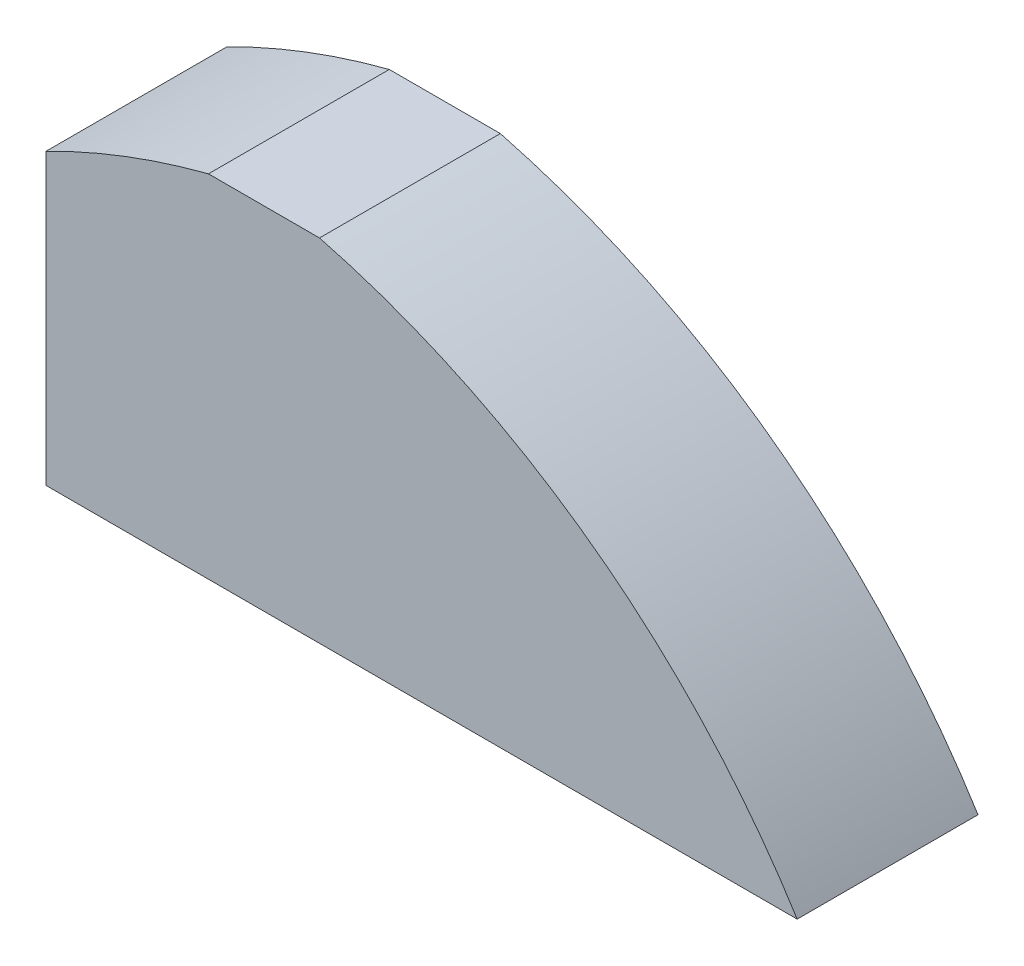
from build123d import *

# Parameters (mm, degrees)
SALIENTE_EXTRUIR2_DEPTH = 500
SALIENTE_EXTRUIR3_DEPTH = 15


with BuildPart() as part:
    # Croquis1 → Saliente-Extruir2 (new body)
    with BuildSketch(Plane.XY):
        with BuildLine():
            Line((-1262.017478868, 358.201119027), (877.522557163, 358.201119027))
            ThreePointArc((877.522557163, 358.201119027), (293.426516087, 989.01444339), (-482.972114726, 1358.201119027))
            Line((-482.972114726, 1358.201119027), (-799.271194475, 1358.201119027))
            ThreePointArc((-799.271194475, 1358.201119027), (-1035.433500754, 1282.980612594), (-1262.017478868, 1182.529329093))
            Line((-1262.017478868, 1182.529329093), (-1262.017478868, 358.201119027))
        make_face()
        with BuildLine():
            ThreePointArc((392.084816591, 873.201119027), (-21.993914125, 1149.708124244), (-486.813846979, 1328.201119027))
            Line((-486.813846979, 1328.201119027), (-795.429462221, 1328.201119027))
            ThreePointArc((-795.429462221, 1328.201119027), (-1017.995059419, 1257.499163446), (-1232.017478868, 1164.072103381))
            Line((-1232.017478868, 1164.072103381), (-1232.017478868, 873.201119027))
            Line((-1232.017478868, 873.201119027), (392.084816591, 873.201119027))
        make_face(mode=Mode.SUBTRACT)
        with BuildLine():
            ThreePointArc((822.721169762, 388.201119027), (640.189943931, 629.041296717), (426.982978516, 843.201119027))
            Line((426.982978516, 843.201119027), (-1232.017478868, 843.201119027))
            Line((-1232.017478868, 843.201119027), (-1232.017478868, 388.201119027))
            Line((-1232.017478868, 388.201119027), (822.721169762, 388.201119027))
        make_face(mode=Mode.SUBTRACT)
    extrude(amount=SALIENTE_EXTRUIR2_DEPTH)

    # Croquis2 → Saliente-Extruir3 (add)
    with BuildSketch(Plane.XY.offset(500)):
        with BuildLine():
            Line((-1262.017478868, 1182.529329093), (-1262.017478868, 358.201119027))
            Line((-1262.017478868, 358.201119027), (877.522557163, 358.201119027))
            ThreePointArc((877.522557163, 358.201119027), (293.426516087, 989.01444339), (-482.972114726, 1358.201119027))
            Line((-482.972114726, 1358.201119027), (-799.271194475, 1358.201119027))
            ThreePointArc((-799.271194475, 1358.201119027), (-1035.433500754, 1282.980612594), (-1262.017478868, 1182.529329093))
        make_face()
    extrude(amount=SALIENTE_EXTRUIR3_DEPTH)


solid = part.part
